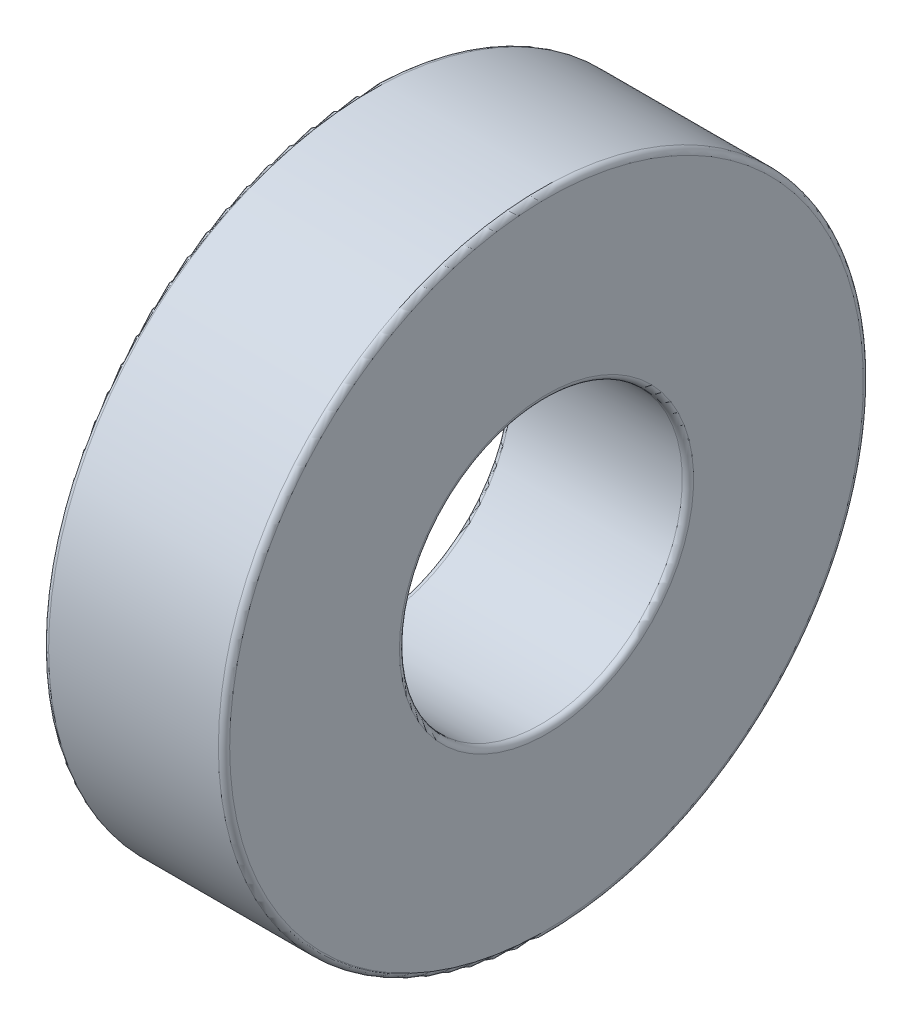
from build123d import *


with BuildPart() as part:
    # Esquisse1 → R_volution1 (revolve)
    with BuildSketch(Plane.XY, mode=Mode.PRIVATE) as r_volution1_sk:
        with BuildLine():
            Line((0.5, 12.5), (15.5, 12.5))
            ThreePointArc((15.5, 12.5), (15.853553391, 12.646446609), (16, 13))
            Line((16, 13), (16, 28))
            ThreePointArc((16, 28), (15.853553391, 28.353553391), (15.5, 28.5))
            Line((15.5, 28.5), (0.5, 28.5))
            ThreePointArc((0.5, 28.5), (0.146446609, 28.353553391), (0, 28))
            Line((0, 28), (0, 13))
            ThreePointArc((0, 13), (0.146446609, 12.646446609), (0.5, 12.5))
        make_face()
    revolve(r_volution1_sk.sketch.rotate(Axis((0, 0, 0), (1, 0, 0)), 90), axis=Axis((0, 0, 0), (1, 0, 0)))


solid = part.part
